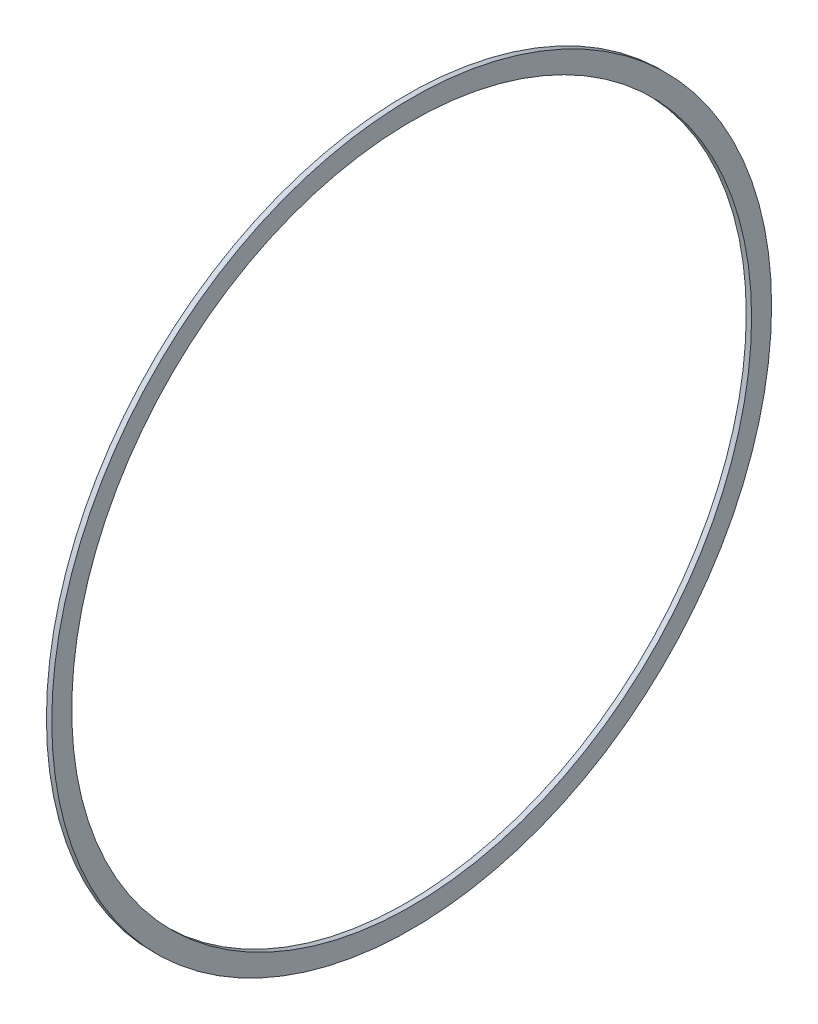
from build123d import *

# Parameters (mm, degrees)
SKETCH_1_W          = 2
SKETCH_1_H          = 135
SKETCH_2_R          = 127.5
CUT_EXTRUDE_1_DEPTH = 191.929306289


with BuildPart() as part:
    # Sketch 1 → Revolve 1 (revolve)
    with BuildSketch(Plane.XY, mode=Mode.PRIVATE) as revolve_1_sk:
        with Locations((1, 67.5)):
            Rectangle(SKETCH_1_W, SKETCH_1_H)
    revolve(revolve_1_sk.sketch.rotate(Axis((0, 0, 0), (1, 0, 0)), 90), axis=Axis((0, 0, 0), (1, 0, 0)))

    # Sketch 2 → Cut-Extrude 1 (cut, through all)
    with BuildSketch(Plane(origin=(2, 0, 0), x_dir=(0, 0, -1), z_dir=(1, 0, 0))):
        Circle(SKETCH_2_R)
    extrude(amount=-CUT_EXTRUDE_1_DEPTH, mode=Mode.SUBTRACT)


solid = part.part
